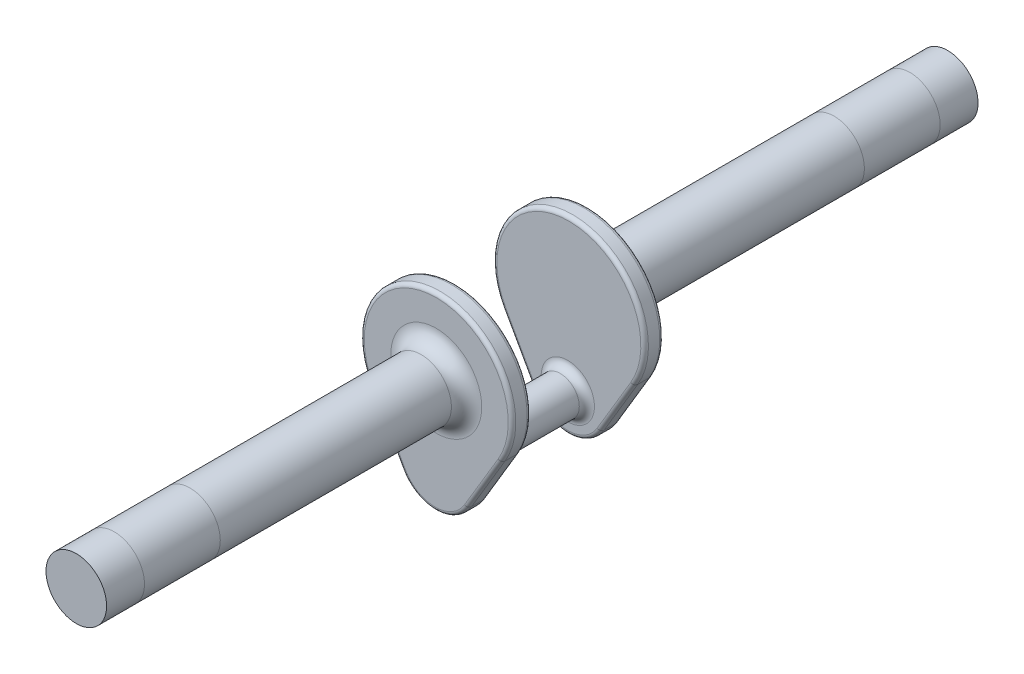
from build123d import *

# Parameters (mm, degrees)
EXTRUDE1_DEPTH = 6.35
SKETCH2_R      = 10.160444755
EXTRUDE2_DEPTH = 120.65
SKETCH3_R      = 6.389172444
EXTRUDE4_DEPTH = 19.05
FILLET1_R      = 2.54
FILLET2_R      = 5.08
FILLET3_R      = 1.27


with BuildPart() as part:
    # Sketch1 → Extrude1 (new body)
    with BuildSketch(Plane.XY):
        with BuildLine():
            Line((-22.174672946, -12.387246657), (-11.445580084, -31.593623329))
            ThreePointArc((-11.445580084, -31.593623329), (-0.537347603, -38.098737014), (10.550006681, -31.903850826))
            Line((10.550006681, -31.903850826), (21.816500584, -13.007701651))
            ThreePointArc((21.816500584, -13.007701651), (0.358207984, 25.397474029), (-22.174672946, -12.387246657))
        make_face()
    extrude(amount=EXTRUDE1_DEPTH)

    # Sketch2 → Extrude2 (add)
    with BuildSketch(Plane(origin=(0, 0, 0), x_dir=(-1, 0, 0), z_dir=(0, 0, -1))):
        with Locations(Location((0, 0, 0), (0, 0, 180))):
            Circle(SKETCH2_R)
    extrude(amount=EXTRUDE2_DEPTH)

    # Sketch3 → Extrude4 (add)
    with BuildSketch(Plane.XY.offset(6.35)):
        with Locations(Location((-0.358243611, -25.4, 0), (0, 0, 180))):
            Circle(SKETCH3_R)
    extrude(amount=EXTRUDE4_DEPTH)

    # Fillet1
    fillet1_edges = [part.edges().sort_by_distance(p)[0] for p in [
        (6.030928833, -25.4, 6.35),
    ]]
    fillet(fillet1_edges, radius=FILLET1_R)

    # Fillet2
    fillet2_edges = [part.edges().sort_by_distance(p)[0] for p in [
        (-10.160444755, 0, 0),
    ]]
    fillet(fillet2_edges, radius=FILLET2_R)

    # Fillet3
    fillet3_edges = [part.edges().sort_by_distance(p)[0] for p in [
        (-0.537347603, -38.098737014, 6.35),
        (16.183253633, -22.455776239, 6.35),
        (0.358207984, 25.397474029, 6.35),
        (16.183253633, -22.455776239, 0),
        (-0.537347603, -38.098737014, 0),
        (-16.810126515, -21.990434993, 0),
        (0.358207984, 25.397474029, 0),
        (-16.810126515, -21.990434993, 6.35),
    ]]
    fillet(fillet3_edges, radius=FILLET3_R)

    # Mirror2: part across plane


with BuildPart() as part_1:
    add(part.part)
    add(part.part.mirror(Plane(origin=(-0.358243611, -25.4, 25.4), x_dir=(1, 0, 0), z_dir=(0, 0, 1))))


solid = part_1.part
